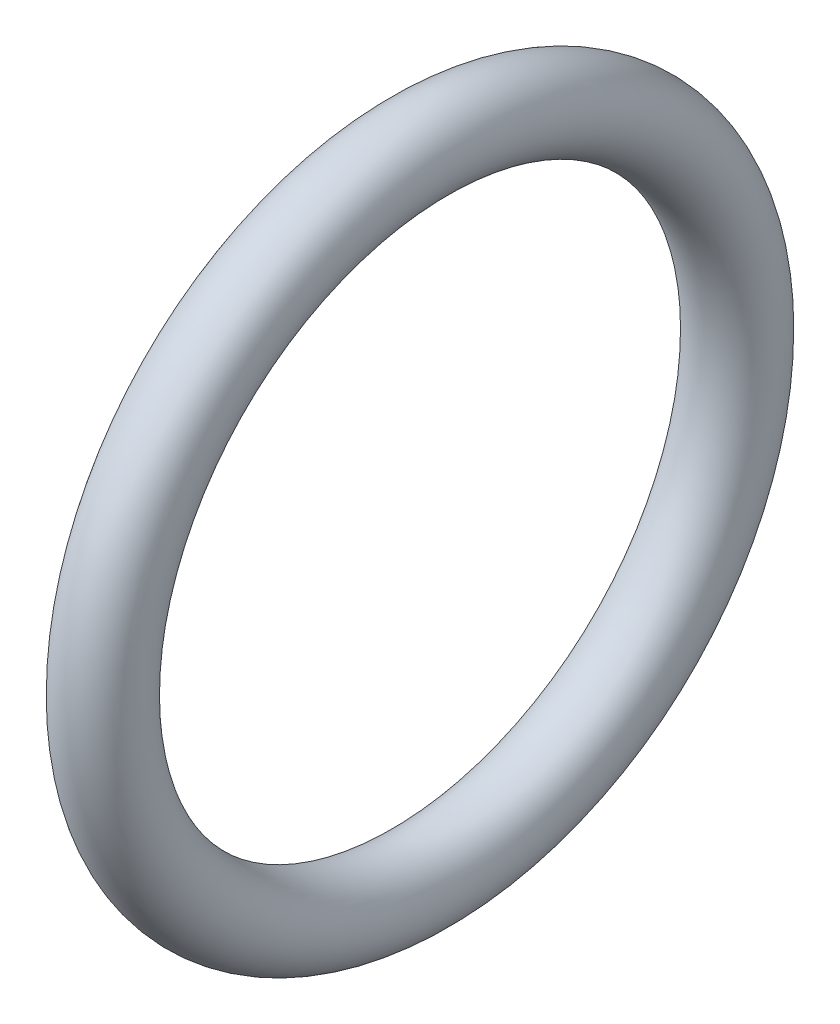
ISO-10303-21;
HEADER;
FILE_DESCRIPTION(('STEP AP214'),'2;1');
FILE_NAME('part.step','',(''),(''),'','','');
FILE_SCHEMA(('AUTOMOTIVE_DESIGN { 1 0 10303 214 1 1 1 1 }'));
ENDSEC;
DATA;
#1=APPLICATION_CONTEXT('core data for automotive mechanical design processes');
#2=APPLICATION_PROTOCOL_DEFINITION('international standard','automotive_design',2000,#1);
#3=PRODUCT_CONTEXT('',#1,'mechanical');
#4=PRODUCT('Part','Part','',(#3));
#5=PRODUCT_RELATED_PRODUCT_CATEGORY('part','',(#4));
#6=PRODUCT_DEFINITION_FORMATION('','',#4);
#7=PRODUCT_DEFINITION_CONTEXT('part definition',#1,'design');
#8=PRODUCT_DEFINITION('design','',#6,#7);
#9=PRODUCT_DEFINITION_SHAPE('','',#8);
#10=(LENGTH_UNIT() NAMED_UNIT(*) SI_UNIT(.MILLI.,.METRE.));
#11=(NAMED_UNIT(*) PLANE_ANGLE_UNIT() SI_UNIT($,.RADIAN.));
#12=(NAMED_UNIT(*) SI_UNIT($,.STERADIAN.) SOLID_ANGLE_UNIT());
#13=UNCERTAINTY_MEASURE_WITH_UNIT(LENGTH_MEASURE(1.E-05),#10,'distance_accuracy_value','');
#14=(GEOMETRIC_REPRESENTATION_CONTEXT(3) GLOBAL_UNCERTAINTY_ASSIGNED_CONTEXT((#13)) GLOBAL_UNIT_ASSIGNED_CONTEXT((#10,
#11,#12)) REPRESENTATION_CONTEXT('',''));
#15=CARTESIAN_POINT('',(0.,0.,0.));
#16=DIRECTION('',(0.,0.,1.));
#17=DIRECTION('',(1.,0.,0.));
#18=AXIS2_PLACEMENT_3D('',#15,#16,#17);
#19=CARTESIAN_POINT('',(0.,0.,0.));
#20=DIRECTION('',(1.,0.,0.));
#21=DIRECTION('',(0.,0.,-1.));
#22=AXIS2_PLACEMENT_3D('',#19,#20,#21);
#23=TOROIDAL_SURFACE('',#22,9.5,1.2);
#24=ADVANCED_FACE('F13',(),#23,.T.);
#25=CLOSED_SHELL('',(#24));
#26=MANIFOLD_SOLID_BREP('B1',#25);
#27=ADVANCED_BREP_SHAPE_REPRESENTATION('',(#18,#26),#14);
#28=SHAPE_DEFINITION_REPRESENTATION(#9,#27);
ENDSEC;
END-ISO-10303-21;
